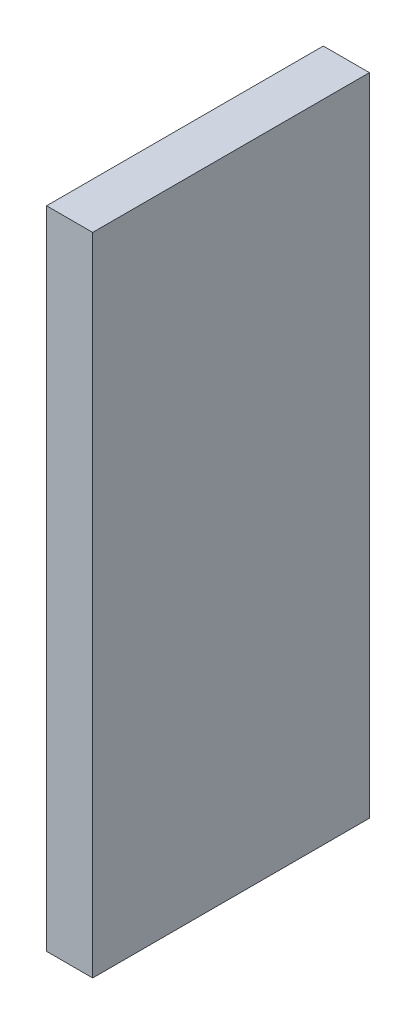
from build123d import *

# Parameters (mm, degrees)
SKETCH1_W           = 6.35
SKETCH1_H           = 88.9
BOSS_EXTRUDE1_DEPTH = 38.1


with BuildPart() as part:
    # Sketch1 → Boss-Extrude1 (new body)
    with BuildSketch(Plane.XY):
        with Locations((-35.700054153, 228.6)):
            Rectangle(SKETCH1_W, SKETCH1_H)
    extrude(amount=BOSS_EXTRUDE1_DEPTH)


solid = part.part
